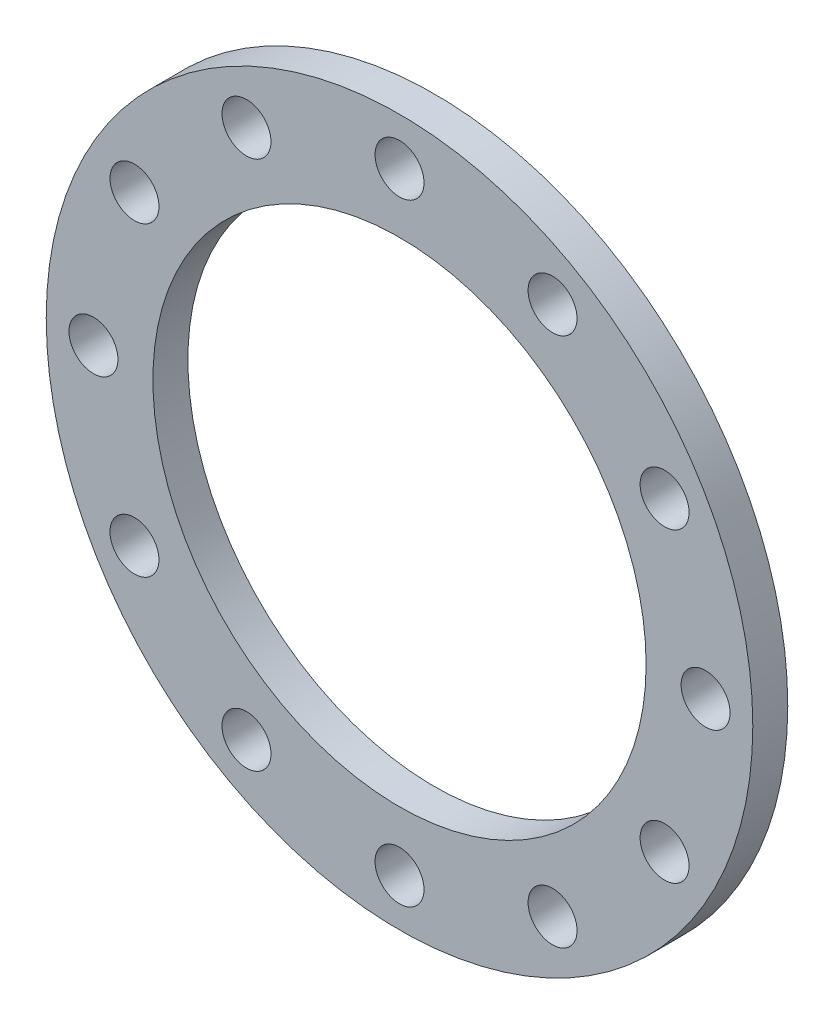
ISO-10303-21;
HEADER;
FILE_DESCRIPTION(('STEP AP214'),'2;1');
FILE_NAME('part.step','',(''),(''),'','','');
FILE_SCHEMA(('AUTOMOTIVE_DESIGN { 1 0 10303 214 1 1 1 1 }'));
ENDSEC;
DATA;
#1=APPLICATION_CONTEXT('core data for automotive mechanical design processes');
#2=APPLICATION_PROTOCOL_DEFINITION('international standard','automotive_design',2000,#1);
#3=PRODUCT_CONTEXT('',#1,'mechanical');
#4=PRODUCT('Part','Part','',(#3));
#5=PRODUCT_RELATED_PRODUCT_CATEGORY('part','',(#4));
#6=PRODUCT_DEFINITION_FORMATION('','',#4);
#7=PRODUCT_DEFINITION_CONTEXT('part definition',#1,'design');
#8=PRODUCT_DEFINITION('design','',#6,#7);
#9=PRODUCT_DEFINITION_SHAPE('','',#8);
#10=(LENGTH_UNIT() NAMED_UNIT(*) SI_UNIT(.MILLI.,.METRE.));
#11=(NAMED_UNIT(*) PLANE_ANGLE_UNIT() SI_UNIT($,.RADIAN.));
#12=(NAMED_UNIT(*) SI_UNIT($,.STERADIAN.) SOLID_ANGLE_UNIT());
#13=UNCERTAINTY_MEASURE_WITH_UNIT(LENGTH_MEASURE(1.E-05),#10,'distance_accuracy_value','');
#14=(GEOMETRIC_REPRESENTATION_CONTEXT(3) GLOBAL_UNCERTAINTY_ASSIGNED_CONTEXT((#13)) GLOBAL_UNIT_ASSIGNED_CONTEXT((#10,
#11,#12)) REPRESENTATION_CONTEXT('',''));
#15=CARTESIAN_POINT('',(0.,0.,0.));
#16=DIRECTION('',(0.,0.,1.));
#17=DIRECTION('',(1.,0.,0.));
#18=AXIS2_PLACEMENT_3D('',#15,#16,#17);
#19=CARTESIAN_POINT('',(0.,0.,1.));
#20=DIRECTION('',(0.,0.,1.));
#21=DIRECTION('',(1.,0.,0.));
#22=AXIS2_PLACEMENT_3D('',#19,#20,#21);
#23=PLANE('',#22);
#24=CARTESIAN_POINT('',(-4.3749999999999,7.57772228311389,1.));
#25=DIRECTION('',(0.,0.,1.));
#26=DIRECTION('',(1.,0.,0.));
#27=AXIS2_PLACEMENT_3D('',#24,#25,#26);
#28=CIRCLE('',#27,0.699999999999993);
#29=CARTESIAN_POINT('',(-3.67499999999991,7.57772228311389,1.));
#30=VERTEX_POINT('',#29);
#31=EDGE_CURVE('E153',#30,#30,#28,.T.);
#32=ORIENTED_EDGE('',*,*,#31,.F.);
#33=EDGE_LOOP('',(#32));
#34=FACE_BOUND('',#33,.T.);
#35=CARTESIAN_POINT('',(-7.57772228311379,4.37500000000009,1.));
#36=DIRECTION('',(0.,0.,1.));
#37=DIRECTION('',(1.,0.,0.));
#38=AXIS2_PLACEMENT_3D('',#35,#36,#37);
#39=CIRCLE('',#38,0.699999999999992);
#40=CARTESIAN_POINT('',(-6.8777222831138,4.37500000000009,1.));
#41=VERTEX_POINT('',#40);
#42=EDGE_CURVE('E145',#41,#41,#39,.T.);
#43=ORIENTED_EDGE('',*,*,#42,.F.);
#44=EDGE_LOOP('',(#43));
#45=FACE_BOUND('',#44,.T.);
#46=CARTESIAN_POINT('',(-8.75,0.,1.));
#47=DIRECTION('',(0.,0.,1.));
#48=DIRECTION('',(1.,0.,0.));
#49=AXIS2_PLACEMENT_3D('',#46,#47,#48);
#50=CIRCLE('',#49,0.699999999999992);
#51=CARTESIAN_POINT('',(-8.05000000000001,0.,1.));
#52=VERTEX_POINT('',#51);
#53=EDGE_CURVE('E137',#52,#52,#50,.T.);
#54=ORIENTED_EDGE('',*,*,#53,.F.);
#55=EDGE_LOOP('',(#54));
#56=FACE_BOUND('',#55,.T.);
#57=CARTESIAN_POINT('',(-7.57772228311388,-4.37499999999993,1.));
#58=DIRECTION('',(0.,0.,1.));
#59=DIRECTION('',(1.,0.,0.));
#60=AXIS2_PLACEMENT_3D('',#57,#58,#59);
#61=CIRCLE('',#60,0.699999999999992);
#62=CARTESIAN_POINT('',(-6.87772228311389,-4.37499999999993,1.));
#63=VERTEX_POINT('',#62);
#64=EDGE_CURVE('E129',#63,#63,#61,.T.);
#65=ORIENTED_EDGE('',*,*,#64,.F.);
#66=EDGE_LOOP('',(#65));
#67=FACE_BOUND('',#66,.T.);
#68=CARTESIAN_POINT('',(-4.37500000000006,-7.5777222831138,1.));
#69=DIRECTION('',(0.,0.,1.));
#70=DIRECTION('',(1.,0.,0.));
#71=AXIS2_PLACEMENT_3D('',#68,#69,#70);
#72=CIRCLE('',#71,0.699999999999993);
#73=CARTESIAN_POINT('',(-3.67500000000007,-7.5777222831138,1.));
#74=VERTEX_POINT('',#73);
#75=EDGE_CURVE('E121',#74,#74,#72,.T.);
#76=ORIENTED_EDGE('',*,*,#75,.F.);
#77=EDGE_LOOP('',(#76));
#78=FACE_BOUND('',#77,.T.);
#79=CARTESIAN_POINT('',(0.,-8.75,1.));
#80=DIRECTION('',(0.,0.,1.));
#81=DIRECTION('',(1.,0.,0.));
#82=AXIS2_PLACEMENT_3D('',#79,#80,#81);
#83=CIRCLE('',#82,0.699999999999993);
#84=CARTESIAN_POINT('',(0.699999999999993,-8.75,1.));
#85=VERTEX_POINT('',#84);
#86=EDGE_CURVE('E113',#85,#85,#83,.T.);
#87=ORIENTED_EDGE('',*,*,#86,.F.);
#88=EDGE_LOOP('',(#87));
#89=FACE_BOUND('',#88,.T.);
#90=CARTESIAN_POINT('',(4.37499999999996,-7.57772228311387,1.));
#91=DIRECTION('',(0.,0.,1.));
#92=DIRECTION('',(1.,0.,0.));
#93=AXIS2_PLACEMENT_3D('',#90,#91,#92);
#94=CIRCLE('',#93,0.699999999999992);
#95=CARTESIAN_POINT('',(5.07499999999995,-7.57772228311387,1.));
#96=VERTEX_POINT('',#95);
#97=EDGE_CURVE('E105',#96,#96,#94,.T.);
#98=ORIENTED_EDGE('',*,*,#97,.F.);
#99=EDGE_LOOP('',(#98));
#100=FACE_BOUND('',#99,.T.);
#101=CARTESIAN_POINT('',(7.57772228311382,-4.37500000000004,1.));
#102=DIRECTION('',(0.,0.,1.));
#103=DIRECTION('',(1.,0.,0.));
#104=AXIS2_PLACEMENT_3D('',#101,#102,#103);
#105=CIRCLE('',#104,0.699999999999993);
#106=CARTESIAN_POINT('',(8.27772228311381,-4.37500000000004,1.));
#107=VERTEX_POINT('',#106);
#108=EDGE_CURVE('E97',#107,#107,#105,.T.);
#109=ORIENTED_EDGE('',*,*,#108,.F.);
#110=EDGE_LOOP('',(#109));
#111=FACE_BOUND('',#110,.T.);
#112=CARTESIAN_POINT('',(8.75,0.,1.));
#113=DIRECTION('',(0.,0.,1.));
#114=DIRECTION('',(1.,0.,0.));
#115=AXIS2_PLACEMENT_3D('',#112,#113,#114);
#116=CIRCLE('',#115,0.699999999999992);
#117=CARTESIAN_POINT('',(9.44999999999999,0.,1.));
#118=VERTEX_POINT('',#117);
#119=EDGE_CURVE('E89',#118,#118,#116,.T.);
#120=ORIENTED_EDGE('',*,*,#119,.F.);
#121=EDGE_LOOP('',(#120));
#122=FACE_BOUND('',#121,.T.);
#123=CARTESIAN_POINT('',(7.57772228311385,4.37499999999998,1.));
#124=DIRECTION('',(0.,0.,1.));
#125=DIRECTION('',(1.,0.,0.));
#126=AXIS2_PLACEMENT_3D('',#123,#124,#125);
#127=CIRCLE('',#126,0.699999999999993);
#128=CARTESIAN_POINT('',(8.27772228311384,4.37499999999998,1.));
#129=VERTEX_POINT('',#128);
#130=EDGE_CURVE('E81',#129,#129,#127,.T.);
#131=ORIENTED_EDGE('',*,*,#130,.F.);
#132=EDGE_LOOP('',(#131));
#133=FACE_BOUND('',#132,.T.);
#134=CARTESIAN_POINT('',(4.37500000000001,7.57772228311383,1.));
#135=DIRECTION('',(0.,0.,1.));
#136=DIRECTION('',(1.,0.,0.));
#137=AXIS2_PLACEMENT_3D('',#134,#135,#136);
#138=CIRCLE('',#137,0.699999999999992);
#139=CARTESIAN_POINT('',(5.075,7.57772228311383,1.));
#140=VERTEX_POINT('',#139);
#141=EDGE_CURVE('E73',#140,#140,#138,.T.);
#142=ORIENTED_EDGE('',*,*,#141,.F.);
#143=EDGE_LOOP('',(#142));
#144=FACE_BOUND('',#143,.T.);
#145=CARTESIAN_POINT('',(0.,8.75,1.));
#146=DIRECTION('',(0.,0.,1.));
#147=DIRECTION('',(1.,0.,0.));
#148=AXIS2_PLACEMENT_3D('',#145,#146,#147);
#149=CIRCLE('',#148,0.699999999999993);
#150=CARTESIAN_POINT('',(0.699999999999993,8.75,1.));
#151=VERTEX_POINT('',#150);
#152=EDGE_CURVE('E65',#151,#151,#149,.T.);
#153=ORIENTED_EDGE('',*,*,#152,.F.);
#154=EDGE_LOOP('',(#153));
#155=FACE_BOUND('',#154,.T.);
#156=CARTESIAN_POINT('',(0.,0.,1.));
#157=DIRECTION('',(0.,0.,1.));
#158=DIRECTION('',(1.,0.,0.));
#159=AXIS2_PLACEMENT_3D('',#156,#157,#158);
#160=CIRCLE('',#159,10.1);
#161=CARTESIAN_POINT('',(10.1,0.,1.));
#162=VERTEX_POINT('',#161);
#163=EDGE_CURVE('E10',#162,#162,#160,.T.);
#164=ORIENTED_EDGE('',*,*,#163,.T.);
#165=EDGE_LOOP('',(#164));
#166=FACE_BOUND('',#165,.T.);
#167=CARTESIAN_POINT('',(0.,0.,1.));
#168=DIRECTION('',(0.,0.,1.));
#169=DIRECTION('',(1.,0.,0.));
#170=AXIS2_PLACEMENT_3D('',#167,#168,#169);
#171=CIRCLE('',#170,7.05);
#172=CARTESIAN_POINT('',(7.05,0.,1.));
#173=VERTEX_POINT('',#172);
#174=EDGE_CURVE('E52',#173,#173,#171,.T.);
#175=ORIENTED_EDGE('',*,*,#174,.F.);
#176=EDGE_LOOP('',(#175));
#177=FACE_BOUND('',#176,.T.);
#178=ADVANCED_FACE('F39',(#34,#45,#56,#67,#78,#89,#100,#111,#122,#133,#144,#155,#166,#177),#23,.T.);
#179=CARTESIAN_POINT('',(0.,0.,0.));
#180=DIRECTION('',(0.,0.,1.));
#181=DIRECTION('',(1.,0.,0.));
#182=AXIS2_PLACEMENT_3D('',#179,#180,#181);
#183=PLANE('',#182);
#184=CARTESIAN_POINT('',(-4.3749999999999,7.57772228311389,0.));
#185=DIRECTION('',(0.,0.,1.));
#186=DIRECTION('',(1.,0.,0.));
#187=AXIS2_PLACEMENT_3D('',#184,#185,#186);
#188=CIRCLE('',#187,0.699999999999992);
#189=CARTESIAN_POINT('',(-3.67499999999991,7.57772228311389,0.));
#190=VERTEX_POINT('',#189);
#191=EDGE_CURVE('E149',#190,#190,#188,.T.);
#192=ORIENTED_EDGE('',*,*,#191,.T.);
#193=EDGE_LOOP('',(#192));
#194=FACE_BOUND('',#193,.T.);
#195=CARTESIAN_POINT('',(-7.57772228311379,4.37500000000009,0.));
#196=DIRECTION('',(0.,0.,1.));
#197=DIRECTION('',(1.,0.,0.));
#198=AXIS2_PLACEMENT_3D('',#195,#196,#197);
#199=CIRCLE('',#198,0.699999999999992);
#200=CARTESIAN_POINT('',(-6.8777222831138,4.37500000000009,0.));
#201=VERTEX_POINT('',#200);
#202=EDGE_CURVE('E141',#201,#201,#199,.T.);
#203=ORIENTED_EDGE('',*,*,#202,.T.);
#204=EDGE_LOOP('',(#203));
#205=FACE_BOUND('',#204,.T.);
#206=CARTESIAN_POINT('',(-8.75,0.,0.));
#207=DIRECTION('',(0.,0.,1.));
#208=DIRECTION('',(1.,0.,0.));
#209=AXIS2_PLACEMENT_3D('',#206,#207,#208);
#210=CIRCLE('',#209,0.699999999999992);
#211=CARTESIAN_POINT('',(-8.05000000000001,0.,0.));
#212=VERTEX_POINT('',#211);
#213=EDGE_CURVE('E133',#212,#212,#210,.T.);
#214=ORIENTED_EDGE('',*,*,#213,.T.);
#215=EDGE_LOOP('',(#214));
#216=FACE_BOUND('',#215,.T.);
#217=CARTESIAN_POINT('',(-7.57772228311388,-4.37499999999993,0.));
#218=DIRECTION('',(0.,0.,1.));
#219=DIRECTION('',(1.,0.,0.));
#220=AXIS2_PLACEMENT_3D('',#217,#218,#219);
#221=CIRCLE('',#220,0.699999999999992);
#222=CARTESIAN_POINT('',(-6.87772228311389,-4.37499999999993,0.));
#223=VERTEX_POINT('',#222);
#224=EDGE_CURVE('E125',#223,#223,#221,.T.);
#225=ORIENTED_EDGE('',*,*,#224,.T.);
#226=EDGE_LOOP('',(#225));
#227=FACE_BOUND('',#226,.T.);
#228=CARTESIAN_POINT('',(-4.37500000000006,-7.5777222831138,0.));
#229=DIRECTION('',(0.,0.,1.));
#230=DIRECTION('',(1.,0.,0.));
#231=AXIS2_PLACEMENT_3D('',#228,#229,#230);
#232=CIRCLE('',#231,0.699999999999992);
#233=CARTESIAN_POINT('',(-3.67500000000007,-7.5777222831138,0.));
#234=VERTEX_POINT('',#233);
#235=EDGE_CURVE('E117',#234,#234,#232,.T.);
#236=ORIENTED_EDGE('',*,*,#235,.T.);
#237=EDGE_LOOP('',(#236));
#238=FACE_BOUND('',#237,.T.);
#239=CARTESIAN_POINT('',(0.,-8.75,0.));
#240=DIRECTION('',(0.,0.,1.));
#241=DIRECTION('',(1.,0.,0.));
#242=AXIS2_PLACEMENT_3D('',#239,#240,#241);
#243=CIRCLE('',#242,0.699999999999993);
#244=CARTESIAN_POINT('',(0.699999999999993,-8.75,0.));
#245=VERTEX_POINT('',#244);
#246=EDGE_CURVE('E109',#245,#245,#243,.T.);
#247=ORIENTED_EDGE('',*,*,#246,.T.);
#248=EDGE_LOOP('',(#247));
#249=FACE_BOUND('',#248,.T.);
#250=CARTESIAN_POINT('',(4.37499999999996,-7.57772228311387,0.));
#251=DIRECTION('',(0.,0.,1.));
#252=DIRECTION('',(1.,0.,0.));
#253=AXIS2_PLACEMENT_3D('',#250,#251,#252);
#254=CIRCLE('',#253,0.699999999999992);
#255=CARTESIAN_POINT('',(5.07499999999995,-7.57772228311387,0.));
#256=VERTEX_POINT('',#255);
#257=EDGE_CURVE('E101',#256,#256,#254,.T.);
#258=ORIENTED_EDGE('',*,*,#257,.T.);
#259=EDGE_LOOP('',(#258));
#260=FACE_BOUND('',#259,.T.);
#261=CARTESIAN_POINT('',(7.57772228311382,-4.37500000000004,0.));
#262=DIRECTION('',(0.,0.,1.));
#263=DIRECTION('',(1.,0.,0.));
#264=AXIS2_PLACEMENT_3D('',#261,#262,#263);
#265=CIRCLE('',#264,0.699999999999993);
#266=CARTESIAN_POINT('',(8.27772228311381,-4.37500000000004,0.));
#267=VERTEX_POINT('',#266);
#268=EDGE_CURVE('E93',#267,#267,#265,.T.);
#269=ORIENTED_EDGE('',*,*,#268,.T.);
#270=EDGE_LOOP('',(#269));
#271=FACE_BOUND('',#270,.T.);
#272=CARTESIAN_POINT('',(8.75,0.,0.));
#273=DIRECTION('',(0.,0.,1.));
#274=DIRECTION('',(1.,0.,0.));
#275=AXIS2_PLACEMENT_3D('',#272,#273,#274);
#276=CIRCLE('',#275,0.699999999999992);
#277=CARTESIAN_POINT('',(9.44999999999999,0.,0.));
#278=VERTEX_POINT('',#277);
#279=EDGE_CURVE('E85',#278,#278,#276,.T.);
#280=ORIENTED_EDGE('',*,*,#279,.T.);
#281=EDGE_LOOP('',(#280));
#282=FACE_BOUND('',#281,.T.);
#283=CARTESIAN_POINT('',(7.57772228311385,4.37499999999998,0.));
#284=DIRECTION('',(0.,0.,1.));
#285=DIRECTION('',(1.,0.,0.));
#286=AXIS2_PLACEMENT_3D('',#283,#284,#285);
#287=CIRCLE('',#286,0.699999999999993);
#288=CARTESIAN_POINT('',(8.27772228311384,4.37499999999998,0.));
#289=VERTEX_POINT('',#288);
#290=EDGE_CURVE('E77',#289,#289,#287,.T.);
#291=ORIENTED_EDGE('',*,*,#290,.T.);
#292=EDGE_LOOP('',(#291));
#293=FACE_BOUND('',#292,.T.);
#294=CARTESIAN_POINT('',(4.37500000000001,7.57772228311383,0.));
#295=DIRECTION('',(0.,0.,1.));
#296=DIRECTION('',(1.,0.,0.));
#297=AXIS2_PLACEMENT_3D('',#294,#295,#296);
#298=CIRCLE('',#297,0.699999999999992);
#299=CARTESIAN_POINT('',(5.075,7.57772228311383,0.));
#300=VERTEX_POINT('',#299);
#301=EDGE_CURVE('E69',#300,#300,#298,.T.);
#302=ORIENTED_EDGE('',*,*,#301,.T.);
#303=EDGE_LOOP('',(#302));
#304=FACE_BOUND('',#303,.T.);
#305=CARTESIAN_POINT('',(0.,8.75,0.));
#306=DIRECTION('',(0.,0.,1.));
#307=DIRECTION('',(1.,0.,0.));
#308=AXIS2_PLACEMENT_3D('',#305,#306,#307);
#309=CIRCLE('',#308,0.699999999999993);
#310=CARTESIAN_POINT('',(0.699999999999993,8.75,0.));
#311=VERTEX_POINT('',#310);
#312=EDGE_CURVE('E58',#311,#311,#309,.T.);
#313=ORIENTED_EDGE('',*,*,#312,.T.);
#314=EDGE_LOOP('',(#313));
#315=FACE_BOUND('',#314,.T.);
#316=CARTESIAN_POINT('',(0.,0.,0.));
#317=DIRECTION('',(0.,0.,1.));
#318=DIRECTION('',(1.,0.,0.));
#319=AXIS2_PLACEMENT_3D('',#316,#317,#318);
#320=CIRCLE('',#319,10.1);
#321=CARTESIAN_POINT('',(10.1,0.,0.));
#322=VERTEX_POINT('',#321);
#323=EDGE_CURVE('E43',#322,#322,#320,.T.);
#324=ORIENTED_EDGE('',*,*,#323,.F.);
#325=EDGE_LOOP('',(#324));
#326=FACE_BOUND('',#325,.T.);
#327=CARTESIAN_POINT('',(0.,0.,0.));
#328=DIRECTION('',(0.,0.,1.));
#329=DIRECTION('',(1.,0.,0.));
#330=AXIS2_PLACEMENT_3D('',#327,#328,#329);
#331=CIRCLE('',#330,7.05);
#332=CARTESIAN_POINT('',(7.05,0.,0.));
#333=VERTEX_POINT('',#332);
#334=EDGE_CURVE('E54',#333,#333,#331,.T.);
#335=ORIENTED_EDGE('',*,*,#334,.T.);
#336=EDGE_LOOP('',(#335));
#337=FACE_BOUND('',#336,.T.);
#338=ADVANCED_FACE('F162',(#194,#205,#216,#227,#238,#249,#260,#271,#282,#293,#304,#315,#326,
#337),#183,.F.);
#339=CARTESIAN_POINT('',(0.,0.,1.));
#340=DIRECTION('',(0.,0.,-1.));
#341=DIRECTION('',(-1.,0.,0.));
#342=AXIS2_PLACEMENT_3D('',#339,#340,#341);
#343=CYLINDRICAL_SURFACE('',#342,10.1);
#344=ORIENTED_EDGE('',*,*,#163,.F.);
#345=EDGE_LOOP('',(#344));
#346=FACE_BOUND('',#345,.T.);
#347=ORIENTED_EDGE('',*,*,#323,.T.);
#348=EDGE_LOOP('',(#347));
#349=FACE_BOUND('',#348,.T.);
#350=ADVANCED_FACE('F41',(#346,#349),#343,.T.);
#351=CARTESIAN_POINT('',(0.,0.,1.));
#352=DIRECTION('',(0.,0.,-1.));
#353=DIRECTION('',(-1.,0.,0.));
#354=AXIS2_PLACEMENT_3D('',#351,#352,#353);
#355=CYLINDRICAL_SURFACE('',#354,7.05);
#356=ORIENTED_EDGE('',*,*,#174,.T.);
#357=EDGE_LOOP('',(#356));
#358=FACE_BOUND('',#357,.T.);
#359=ORIENTED_EDGE('',*,*,#334,.F.);
#360=EDGE_LOOP('',(#359));
#361=FACE_BOUND('',#360,.T.);
#362=ADVANCED_FACE('F188',(#358,#361),#355,.F.);
#363=CARTESIAN_POINT('',(0.,8.75,1.));
#364=DIRECTION('',(0.,0.,1.));
#365=DIRECTION('',(1.,0.,0.));
#366=AXIS2_PLACEMENT_3D('',#363,#364,#365);
#367=CYLINDRICAL_SURFACE('',#366,0.699999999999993);
#368=ORIENTED_EDGE('',*,*,#312,.F.);
#369=EDGE_LOOP('',(#368));
#370=FACE_BOUND('',#369,.T.);
#371=ORIENTED_EDGE('',*,*,#152,.T.);
#372=EDGE_LOOP('',(#371));
#373=FACE_BOUND('',#372,.T.);
#374=ADVANCED_FACE('F191',(#370,#373),#367,.F.);
#375=CARTESIAN_POINT('',(4.37500000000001,7.57772228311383,1.));
#376=DIRECTION('',(0.,0.,1.));
#377=DIRECTION('',(1.,0.,0.));
#378=AXIS2_PLACEMENT_3D('',#375,#376,#377);
#379=CYLINDRICAL_SURFACE('',#378,0.699999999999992);
#380=ORIENTED_EDGE('',*,*,#301,.F.);
#381=EDGE_LOOP('',(#380));
#382=FACE_BOUND('',#381,.T.);
#383=ORIENTED_EDGE('',*,*,#141,.T.);
#384=EDGE_LOOP('',(#383));
#385=FACE_BOUND('',#384,.T.);
#386=ADVANCED_FACE('F205',(#382,#385),#379,.F.);
#387=CARTESIAN_POINT('',(7.57772228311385,4.37499999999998,1.));
#388=DIRECTION('',(0.,0.,1.));
#389=DIRECTION('',(1.,0.,0.));
#390=AXIS2_PLACEMENT_3D('',#387,#388,#389);
#391=CYLINDRICAL_SURFACE('',#390,0.699999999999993);
#392=ORIENTED_EDGE('',*,*,#290,.F.);
#393=EDGE_LOOP('',(#392));
#394=FACE_BOUND('',#393,.T.);
#395=ORIENTED_EDGE('',*,*,#130,.T.);
#396=EDGE_LOOP('',(#395));
#397=FACE_BOUND('',#396,.T.);
#398=ADVANCED_FACE('F209',(#394,#397),#391,.F.);
#399=CARTESIAN_POINT('',(8.75,0.,1.));
#400=DIRECTION('',(0.,0.,1.));
#401=DIRECTION('',(1.,0.,0.));
#402=AXIS2_PLACEMENT_3D('',#399,#400,#401);
#403=CYLINDRICAL_SURFACE('',#402,0.699999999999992);
#404=ORIENTED_EDGE('',*,*,#279,.F.);
#405=EDGE_LOOP('',(#404));
#406=FACE_BOUND('',#405,.T.);
#407=ORIENTED_EDGE('',*,*,#119,.T.);
#408=EDGE_LOOP('',(#407));
#409=FACE_BOUND('',#408,.T.);
#410=ADVANCED_FACE('F213',(#406,#409),#403,.F.);
#411=CARTESIAN_POINT('',(7.57772228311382,-4.37500000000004,1.));
#412=DIRECTION('',(0.,0.,1.));
#413=DIRECTION('',(1.,0.,0.));
#414=AXIS2_PLACEMENT_3D('',#411,#412,#413);
#415=CYLINDRICAL_SURFACE('',#414,0.699999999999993);
#416=ORIENTED_EDGE('',*,*,#268,.F.);
#417=EDGE_LOOP('',(#416));
#418=FACE_BOUND('',#417,.T.);
#419=ORIENTED_EDGE('',*,*,#108,.T.);
#420=EDGE_LOOP('',(#419));
#421=FACE_BOUND('',#420,.T.);
#422=ADVANCED_FACE('F217',(#418,#421),#415,.F.);
#423=CARTESIAN_POINT('',(4.37499999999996,-7.57772228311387,1.));
#424=DIRECTION('',(0.,0.,1.));
#425=DIRECTION('',(1.,0.,0.));
#426=AXIS2_PLACEMENT_3D('',#423,#424,#425);
#427=CYLINDRICAL_SURFACE('',#426,0.699999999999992);
#428=ORIENTED_EDGE('',*,*,#257,.F.);
#429=EDGE_LOOP('',(#428));
#430=FACE_BOUND('',#429,.T.);
#431=ORIENTED_EDGE('',*,*,#97,.T.);
#432=EDGE_LOOP('',(#431));
#433=FACE_BOUND('',#432,.T.);
#434=ADVANCED_FACE('F221',(#430,#433),#427,.F.);
#435=CARTESIAN_POINT('',(0.,-8.75,1.));
#436=DIRECTION('',(0.,0.,1.));
#437=DIRECTION('',(1.,0.,0.));
#438=AXIS2_PLACEMENT_3D('',#435,#436,#437);
#439=CYLINDRICAL_SURFACE('',#438,0.699999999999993);
#440=ORIENTED_EDGE('',*,*,#246,.F.);
#441=EDGE_LOOP('',(#440));
#442=FACE_BOUND('',#441,.T.);
#443=ORIENTED_EDGE('',*,*,#86,.T.);
#444=EDGE_LOOP('',(#443));
#445=FACE_BOUND('',#444,.T.);
#446=ADVANCED_FACE('F225',(#442,#445),#439,.F.);
#447=CARTESIAN_POINT('',(-4.37500000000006,-7.5777222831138,1.));
#448=DIRECTION('',(0.,0.,1.));
#449=DIRECTION('',(1.,0.,0.));
#450=AXIS2_PLACEMENT_3D('',#447,#448,#449);
#451=CYLINDRICAL_SURFACE('',#450,0.699999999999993);
#452=ORIENTED_EDGE('',*,*,#235,.F.);
#453=EDGE_LOOP('',(#452));
#454=FACE_BOUND('',#453,.T.);
#455=ORIENTED_EDGE('',*,*,#75,.T.);
#456=EDGE_LOOP('',(#455));
#457=FACE_BOUND('',#456,.T.);
#458=ADVANCED_FACE('F229',(#454,#457),#451,.F.);
#459=CARTESIAN_POINT('',(-7.57772228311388,-4.37499999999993,1.));
#460=DIRECTION('',(0.,0.,1.));
#461=DIRECTION('',(1.,0.,0.));
#462=AXIS2_PLACEMENT_3D('',#459,#460,#461);
#463=CYLINDRICAL_SURFACE('',#462,0.699999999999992);
#464=ORIENTED_EDGE('',*,*,#224,.F.);
#465=EDGE_LOOP('',(#464));
#466=FACE_BOUND('',#465,.T.);
#467=ORIENTED_EDGE('',*,*,#64,.T.);
#468=EDGE_LOOP('',(#467));
#469=FACE_BOUND('',#468,.T.);
#470=ADVANCED_FACE('F233',(#466,#469),#463,.F.);
#471=CARTESIAN_POINT('',(-8.75,0.,1.));
#472=DIRECTION('',(0.,0.,1.));
#473=DIRECTION('',(1.,0.,0.));
#474=AXIS2_PLACEMENT_3D('',#471,#472,#473);
#475=CYLINDRICAL_SURFACE('',#474,0.699999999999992);
#476=ORIENTED_EDGE('',*,*,#213,.F.);
#477=EDGE_LOOP('',(#476));
#478=FACE_BOUND('',#477,.T.);
#479=ORIENTED_EDGE('',*,*,#53,.T.);
#480=EDGE_LOOP('',(#479));
#481=FACE_BOUND('',#480,.T.);
#482=ADVANCED_FACE('F237',(#478,#481),#475,.F.);
#483=CARTESIAN_POINT('',(-7.57772228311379,4.37500000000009,1.));
#484=DIRECTION('',(0.,0.,1.));
#485=DIRECTION('',(1.,0.,0.));
#486=AXIS2_PLACEMENT_3D('',#483,#484,#485);
#487=CYLINDRICAL_SURFACE('',#486,0.699999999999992);
#488=ORIENTED_EDGE('',*,*,#202,.F.);
#489=EDGE_LOOP('',(#488));
#490=FACE_BOUND('',#489,.T.);
#491=ORIENTED_EDGE('',*,*,#42,.T.);
#492=EDGE_LOOP('',(#491));
#493=FACE_BOUND('',#492,.T.);
#494=ADVANCED_FACE('F241',(#490,#493),#487,.F.);
#495=CARTESIAN_POINT('',(-4.3749999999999,7.57772228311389,1.));
#496=DIRECTION('',(0.,0.,1.));
#497=DIRECTION('',(1.,0.,0.));
#498=AXIS2_PLACEMENT_3D('',#495,#496,#497);
#499=CYLINDRICAL_SURFACE('',#498,0.699999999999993);
#500=ORIENTED_EDGE('',*,*,#191,.F.);
#501=EDGE_LOOP('',(#500));
#502=FACE_BOUND('',#501,.T.);
#503=ORIENTED_EDGE('',*,*,#31,.T.);
#504=EDGE_LOOP('',(#503));
#505=FACE_BOUND('',#504,.T.);
#506=ADVANCED_FACE('F158',(#502,#505),#499,.F.);
#507=CLOSED_SHELL('',(#178,#338,#350,#362,#374,#386,#398,#410,#422,#434,#446,#458,#470,#482,
#494,#506));
#508=MANIFOLD_SOLID_BREP('B2',#507);
#509=ADVANCED_BREP_SHAPE_REPRESENTATION('',(#18,#508),#14);
#510=SHAPE_DEFINITION_REPRESENTATION(#9,#509);
ENDSEC;
END-ISO-10303-21;
